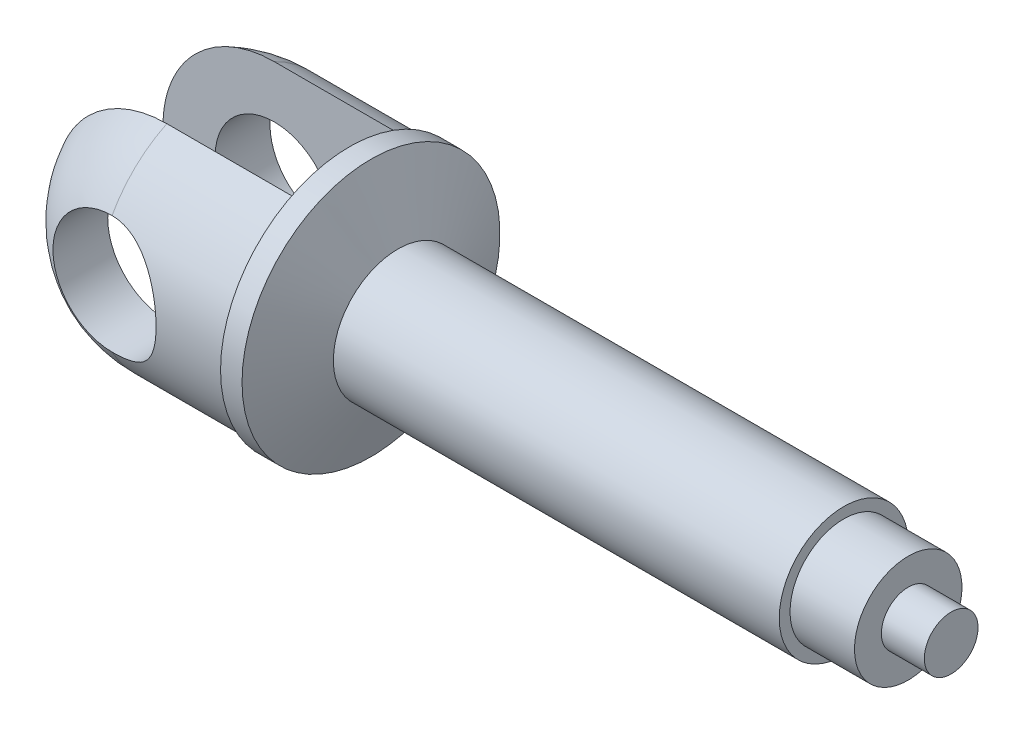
ISO-10303-21;
HEADER;
FILE_DESCRIPTION(('STEP AP214'),'2;1');
FILE_NAME('part.step','',(''),(''),'','','');
FILE_SCHEMA(('AUTOMOTIVE_DESIGN { 1 0 10303 214 1 1 1 1 }'));
ENDSEC;
DATA;
#1=APPLICATION_CONTEXT('core data for automotive mechanical design processes');
#2=APPLICATION_PROTOCOL_DEFINITION('international standard','automotive_design',2000,#1);
#3=PRODUCT_CONTEXT('',#1,'mechanical');
#4=PRODUCT('Part','Part','',(#3));
#5=PRODUCT_RELATED_PRODUCT_CATEGORY('part','',(#4));
#6=PRODUCT_DEFINITION_FORMATION('','',#4);
#7=PRODUCT_DEFINITION_CONTEXT('part definition',#1,'design');
#8=PRODUCT_DEFINITION('design','',#6,#7);
#9=PRODUCT_DEFINITION_SHAPE('','',#8);
#10=(LENGTH_UNIT() NAMED_UNIT(*) SI_UNIT(.MILLI.,.METRE.));
#11=(NAMED_UNIT(*) PLANE_ANGLE_UNIT() SI_UNIT($,.RADIAN.));
#12=(NAMED_UNIT(*) SI_UNIT($,.STERADIAN.) SOLID_ANGLE_UNIT());
#13=UNCERTAINTY_MEASURE_WITH_UNIT(LENGTH_MEASURE(1.E-05),#10,'distance_accuracy_value','');
#14=(GEOMETRIC_REPRESENTATION_CONTEXT(3) GLOBAL_UNCERTAINTY_ASSIGNED_CONTEXT((#13)) GLOBAL_UNIT_ASSIGNED_CONTEXT((#10,
#11,#12)) REPRESENTATION_CONTEXT('',''));
#15=CARTESIAN_POINT('',(0.,0.,0.));
#16=DIRECTION('',(0.,0.,1.));
#17=DIRECTION('',(1.,0.,0.));
#18=AXIS2_PLACEMENT_3D('',#15,#16,#17);
#19=CARTESIAN_POINT('',(-136.,0.,0.));
#20=DIRECTION('',(-1.,0.,0.));
#21=DIRECTION('',(0.,0.,1.));
#22=AXIS2_PLACEMENT_3D('',#19,#20,#21);
#23=CYLINDRICAL_SURFACE('',#22,23.);
#24=CARTESIAN_POINT('',(-136.,0.,0.));
#25=DIRECTION('',(-1.,0.,0.));
#26=DIRECTION('',(0.,0.,1.));
#27=AXIS2_PLACEMENT_3D('',#24,#25,#26);
#28=CIRCLE('',#27,23.);
#29=CARTESIAN_POINT('',(-136.,11.,20.1990098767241));
#30=VERTEX_POINT('',#29);
#31=CARTESIAN_POINT('',(-136.,20.712315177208,10.));
#32=VERTEX_POINT('',#31);
#33=EDGE_CURVE('E109',#30,#32,#28,.T.);
#34=ORIENTED_EDGE('',*,*,#33,.F.);
#35=CARTESIAN_POINT('',(-136.,11.,20.1990098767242));
#36=CARTESIAN_POINT('',(-135.855019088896,11.0000009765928,20.1990068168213));
#37=CARTESIAN_POINT('',(-135.710058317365,10.9971331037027,20.2005714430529));
#38=CARTESIAN_POINT('',(-135.420436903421,10.9856774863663,20.2068045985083));
#39=CARTESIAN_POINT('',(-135.27577624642,10.9770900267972,20.2114729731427));
#40=CARTESIAN_POINT('',(-134.842838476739,10.9427924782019,20.2300770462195));
#41=CARTESIAN_POINT('',(-134.555377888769,10.9085471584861,20.2486117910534));
#42=CARTESIAN_POINT('',(-133.986571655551,10.8179778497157,20.2971415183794));
#43=CARTESIAN_POINT('',(-133.705201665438,10.7617719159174,20.327075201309));
#44=CARTESIAN_POINT('',(-133.148912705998,10.6279419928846,20.3973663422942));
#45=CARTESIAN_POINT('',(-132.87399439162,10.5503158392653,20.4377248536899));
#46=CARTESIAN_POINT('',(-132.332944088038,10.3746528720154,20.5274516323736));
#47=CARTESIAN_POINT('',(-132.066794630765,10.2766598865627,20.576800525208));
#48=CARTESIAN_POINT('',(-131.544081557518,10.061053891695,20.6830758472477));
#49=CARTESIAN_POINT('',(-131.287521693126,9.94343330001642,20.740005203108));
#50=CARTESIAN_POINT('',(-130.533754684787,9.56227778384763,20.9198925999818));
#51=CARTESIAN_POINT('',(-130.05268558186,9.27052305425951,21.0519103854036));
#52=CARTESIAN_POINT('',(-129.108612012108,8.59479159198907,21.3371347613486));
#53=CARTESIAN_POINT('',(-128.649619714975,8.20556564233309,21.4911871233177));
#54=CARTESIAN_POINT('',(-128.013007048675,7.56955566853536,21.7198729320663));
#55=CARTESIAN_POINT('',(-127.809338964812,7.34870448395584,21.795748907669));
#56=CARTESIAN_POINT('',(-127.420379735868,6.89059554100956,21.9448767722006));
#57=CARTESIAN_POINT('',(-127.23508190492,6.65334380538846,22.0181296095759));
#58=CARTESIAN_POINT('',(-126.873321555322,6.1486525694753,22.1645494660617));
#59=CARTESIAN_POINT('',(-126.698082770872,5.88025462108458,22.237440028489));
#60=CARTESIAN_POINT('',(-126.371003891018,5.32780141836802,22.3762291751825));
#61=CARTESIAN_POINT('',(-126.219165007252,5.04374535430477,22.4421273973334));
#62=CARTESIAN_POINT('',(-125.940423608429,4.46194116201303,22.5650045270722));
#63=CARTESIAN_POINT('',(-125.813510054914,4.16419916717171,22.6219873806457));
#64=CARTESIAN_POINT('',(-125.585953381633,3.55706324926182,22.7253621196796));
#65=CARTESIAN_POINT('',(-125.48530774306,3.2476704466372,22.7717550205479));
#66=CARTESIAN_POINT('',(-125.317277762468,2.64045999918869,22.8498446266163));
#67=CARTESIAN_POINT('',(-125.248135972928,2.34322700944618,22.8823094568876));
#68=CARTESIAN_POINT('',(-125.134685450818,1.7430415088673,22.9358355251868));
#69=CARTESIAN_POINT('',(-125.090375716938,1.44008922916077,22.9568972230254));
#70=CARTESIAN_POINT('',(-125.027170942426,0.831085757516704,22.987000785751));
#71=CARTESIAN_POINT('',(-125.00826459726,0.525036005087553,22.9960479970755));
#72=CARTESIAN_POINT('',(-124.996083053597,-0.0876829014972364,23.0018728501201));
#73=CARTESIAN_POINT('',(-125.002806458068,-0.394352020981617,22.9986511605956));
#74=CARTESIAN_POINT('',(-125.040228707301,-0.981253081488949,22.9807822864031));
#75=CARTESIAN_POINT('',(-125.068970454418,-1.26164089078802,22.9670678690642));
#76=CARTESIAN_POINT('',(-125.14774712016,-1.81871733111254,22.9296792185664));
#77=CARTESIAN_POINT('',(-125.197780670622,-2.09540619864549,22.9060056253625));
#78=CARTESIAN_POINT('',(-125.318611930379,-2.64322368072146,22.8492715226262));
#79=CARTESIAN_POINT('',(-125.389409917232,-2.91435222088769,22.8162108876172));
#80=CARTESIAN_POINT('',(-125.551068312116,-3.44933718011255,22.7414828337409));
#81=CARTESIAN_POINT('',(-125.64192940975,-3.71319334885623,22.6998151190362));
#82=CARTESIAN_POINT('',(-125.844345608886,-4.23583822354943,22.6081633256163));
#83=CARTESIAN_POINT('',(-125.956179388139,-4.49449957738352,22.5580683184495));
#84=CARTESIAN_POINT('',(-126.198726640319,-5.00140718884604,22.4511280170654));
#85=CARTESIAN_POINT('',(-126.329446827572,-5.24964970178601,22.3942803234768));
#86=CARTESIAN_POINT('',(-126.748468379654,-5.9767758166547,22.2154612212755));
#87=CARTESIAN_POINT('',(-127.06375037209,-6.43836433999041,22.0851578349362));
#88=CARTESIAN_POINT('',(-127.789221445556,-7.34502606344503,21.8012843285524));
#89=CARTESIAN_POINT('',(-128.20533293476,-7.78504117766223,21.6466757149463));
#90=CARTESIAN_POINT('',(-128.879247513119,-8.38965271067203,21.4163615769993));
#91=CARTESIAN_POINT('',(-129.112371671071,-8.58207893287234,21.3397994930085));
#92=CARTESIAN_POINT('',(-129.594278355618,-8.94752022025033,21.1891689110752));
#93=CARTESIAN_POINT('',(-129.843063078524,-9.12053255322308,21.11510076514));
#94=CARTESIAN_POINT('',(-130.369160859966,-9.45495177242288,20.9675736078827));
#95=CARTESIAN_POINT('',(-130.647290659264,-9.61518988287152,20.8943741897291));
#96=CARTESIAN_POINT('',(-131.21787942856,-9.91133624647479,20.7555331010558));
#97=CARTESIAN_POINT('',(-131.510332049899,-10.0472551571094,20.6898881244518));
#98=CARTESIAN_POINT('',(-132.107361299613,-10.2932693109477,20.5686026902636));
#99=CARTESIAN_POINT('',(-132.411917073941,-10.4034068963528,20.5129458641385));
#100=CARTESIAN_POINT('',(-133.031204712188,-10.5967680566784,20.4137282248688));
#101=CARTESIAN_POINT('',(-133.345932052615,-10.6800034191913,20.3701621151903));
#102=CARTESIAN_POINT('',(-134.046100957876,-10.8321022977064,20.2897641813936));
#103=CARTESIAN_POINT('',(-134.433253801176,-10.8948997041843,20.2559520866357));
#104=CARTESIAN_POINT('',(-135.01827359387,-10.957867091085,20.2219098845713));
#105=CARTESIAN_POINT('',(-135.214126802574,-10.9736515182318,20.2133416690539));
#106=CARTESIAN_POINT('',(-135.606634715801,-10.9947211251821,20.2018857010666));
#107=CARTESIAN_POINT('',(-135.803289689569,-11.0000024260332,20.1990000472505));
#108=CARTESIAN_POINT('',(-136.,-11.,20.1990098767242));
#109=B_SPLINE_CURVE_WITH_KNOTS('',3,(#35,#36,#37,#38,#39,#40,#41,#42,#43,#44,#45,#46,#47,#48,
#49,#50,#51,#52,#53,#54,#55,#56,#57,#58,#59,#60,#61,#62,#63,#64,#65,#66,#67,#68,#69,#70,#71,#72,
#73,#74,#75,#76,#77,#78,#79,#80,#81,#82,#83,#84,#85,#86,#87,#88,#89,#90,#91,#92,#93,#94,#95,#96,
#97,#98,#99,#100,#101,#102,#103,#104,#105,#106,#107,#108),.UNSPECIFIED.,.F.,.F.,(4,2,2,2,2,2,2,
2,2,2,2,2,2,2,2,2,2,2,2,2,2,2,2,2,2,2,2,2,2,2,2,2,2,2,2,2,4),(0.,0.434866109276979,
0.869710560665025,1.73871892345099,2.60311858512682,3.46760562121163,4.33025124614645,
5.19323089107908,6.91990369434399,8.77514242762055,9.70391075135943,10.6323397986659,
11.6172637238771,12.6022386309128,13.5867763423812,14.5712196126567,15.4906593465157,
16.4100620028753,17.3290553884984,18.247998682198,19.0935720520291,19.9390910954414,
20.7846214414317,21.6301808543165,22.4878941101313,23.3459130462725,25.0609611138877,
26.9274624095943,27.8621247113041,28.7969183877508,29.7833424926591,30.7693332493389,
31.7536931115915,32.7376210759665,33.9154782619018,34.5051908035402,35.0951210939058),.UNSPECIFIED.);
#110=CARTESIAN_POINT('',(-136.,-11.,20.1990098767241));
#111=VERTEX_POINT('',#110);
#112=EDGE_CURVE('E48',#30,#111,#109,.T.);
#113=ORIENTED_EDGE('',*,*,#112,.T.);
#114=CARTESIAN_POINT('',(-136.,-20.712315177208,10.));
#115=VERTEX_POINT('',#114);
#116=EDGE_CURVE('E105',#115,#111,#28,.T.);
#117=ORIENTED_EDGE('',*,*,#116,.F.);
#118=DIRECTION('',(-1.,0.,0.));
#119=VECTOR('',#118,1.);
#120=CARTESIAN_POINT('',(-136.,-20.712315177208,10.));
#121=LINE('',#120,#119);
#122=CARTESIAN_POINT('',(-112.,-20.712315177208,10.));
#123=VERTEX_POINT('',#122);
#124=EDGE_CURVE('E115',#123,#115,#121,.T.);
#125=ORIENTED_EDGE('',*,*,#124,.F.);
#126=CARTESIAN_POINT('',(-112.,0.,0.));
#127=DIRECTION('',(-1.,0.,0.));
#128=DIRECTION('',(0.,0.,1.));
#129=AXIS2_PLACEMENT_3D('',#126,#127,#128);
#130=CIRCLE('',#129,23.);
#131=CARTESIAN_POINT('',(-112.,20.712315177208,10.));
#132=VERTEX_POINT('',#131);
#133=EDGE_CURVE('E103',#123,#132,#130,.T.);
#134=ORIENTED_EDGE('',*,*,#133,.T.);
#135=DIRECTION('',(-1.,0.,0.));
#136=VECTOR('',#135,1.);
#137=CARTESIAN_POINT('',(-136.,20.712315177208,10.));
#138=LINE('',#137,#136);
#139=EDGE_CURVE('E117',#32,#132,#138,.F.);
#140=ORIENTED_EDGE('',*,*,#139,.F.);
#141=EDGE_LOOP('',(#34,#113,#117,#125,#134,#140));
#142=FACE_BOUND('',#141,.T.);
#143=ADVANCED_FACE('F33',(#142),#23,.T.);
#144=CARTESIAN_POINT('',(-136.,0.,0.));
#145=DIRECTION('',(-1.,0.,0.));
#146=DIRECTION('',(0.,1.,0.));
#147=AXIS2_PLACEMENT_3D('',#144,#145,#146);
#148=SPHERICAL_SURFACE('',#147,23.);
#149=ORIENTED_EDGE('',*,*,#116,.T.);
#150=CARTESIAN_POINT('',(-136.,0.,20.1990098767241));
#151=DIRECTION('',(0.,0.,-1.));
#152=DIRECTION('',(-1.,0.,0.));
#153=AXIS2_PLACEMENT_3D('',#150,#151,#152);
#154=CIRCLE('',#153,11.);
#155=EDGE_CURVE('E98',#111,#30,#154,.T.);
#156=ORIENTED_EDGE('',*,*,#155,.T.);
#157=ORIENTED_EDGE('',*,*,#33,.T.);
#158=CARTESIAN_POINT('',(-136.,0.,10.));
#159=DIRECTION('',(0.,0.,-1.));
#160=DIRECTION('',(-1.,0.,0.));
#161=AXIS2_PLACEMENT_3D('',#158,#159,#160);
#162=CIRCLE('',#161,20.712315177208);
#163=EDGE_CURVE('E11',#115,#32,#162,.T.);
#164=ORIENTED_EDGE('',*,*,#163,.F.);
#165=EDGE_LOOP('',(#149,#156,#157,#164));
#166=FACE_BOUND('',#165,.T.);
#167=ADVANCED_FACE('F165',(#166),#148,.T.);
#168=CARTESIAN_POINT('',(0.,0.,0.));
#169=DIRECTION('',(-1.,0.,0.));
#170=DIRECTION('',(0.,0.,1.));
#171=AXIS2_PLACEMENT_3D('',#168,#169,#170);
#172=PLANE('',#171);
#173=CARTESIAN_POINT('',(0.,0.,0.));
#174=DIRECTION('',(-1.,0.,0.));
#175=DIRECTION('',(0.,0.,1.));
#176=AXIS2_PLACEMENT_3D('',#173,#174,#175);
#177=CIRCLE('',#176,5.);
#178=CARTESIAN_POINT('',(0.,0.,5.));
#179=VERTEX_POINT('',#178);
#180=EDGE_CURVE('E218',#179,#179,#177,.T.);
#181=ORIENTED_EDGE('',*,*,#180,.F.);
#182=EDGE_LOOP('',(#181));
#183=FACE_BOUND('',#182,.T.);
#184=ADVANCED_FACE('F35',(#183),#172,.F.);
#185=CARTESIAN_POINT('',(-136.,0.,0.));
#186=DIRECTION('',(-1.,0.,0.));
#187=DIRECTION('',(0.,0.,1.));
#188=AXIS2_PLACEMENT_3D('',#185,#186,#187);
#189=CYLINDRICAL_SURFACE('',#188,5.);
#190=CARTESIAN_POINT('',(-8.00000000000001,0.,0.));
#191=DIRECTION('',(-1.,0.,0.));
#192=DIRECTION('',(0.,0.,1.));
#193=AXIS2_PLACEMENT_3D('',#190,#191,#192);
#194=CIRCLE('',#193,5.);
#195=CARTESIAN_POINT('',(-8.00000000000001,0.,5.));
#196=VERTEX_POINT('',#195);
#197=EDGE_CURVE('E215',#196,#196,#194,.T.);
#198=ORIENTED_EDGE('',*,*,#197,.F.);
#199=EDGE_LOOP('',(#198));
#200=FACE_BOUND('',#199,.T.);
#201=ORIENTED_EDGE('',*,*,#180,.T.);
#202=EDGE_LOOP('',(#201));
#203=FACE_BOUND('',#202,.T.);
#204=ADVANCED_FACE('F204',(#200,#203),#189,.T.);
#205=CARTESIAN_POINT('',(-8.,5.,0.));
#206=DIRECTION('',(-1.,0.,0.));
#207=DIRECTION('',(0.,0.,1.));
#208=AXIS2_PLACEMENT_3D('',#205,#206,#207);
#209=PLANE('',#208);
#210=CARTESIAN_POINT('',(-8.00000000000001,0.,0.));
#211=DIRECTION('',(-1.,0.,0.));
#212=DIRECTION('',(0.,0.,1.));
#213=AXIS2_PLACEMENT_3D('',#210,#211,#212);
#214=CIRCLE('',#213,10.);
#215=CARTESIAN_POINT('',(-8.00000000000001,0.,10.));
#216=VERTEX_POINT('',#215);
#217=EDGE_CURVE('E221',#216,#216,#214,.T.);
#218=ORIENTED_EDGE('',*,*,#217,.F.);
#219=EDGE_LOOP('',(#218));
#220=FACE_BOUND('',#219,.T.);
#221=ORIENTED_EDGE('',*,*,#197,.T.);
#222=EDGE_LOOP('',(#221));
#223=FACE_BOUND('',#222,.T.);
#224=ADVANCED_FACE('F201',(#220,#223),#209,.F.);
#225=CARTESIAN_POINT('',(-136.,0.,0.));
#226=DIRECTION('',(-1.,0.,0.));
#227=DIRECTION('',(0.,0.,1.));
#228=AXIS2_PLACEMENT_3D('',#225,#226,#227);
#229=CYLINDRICAL_SURFACE('',#228,10.);
#230=CARTESIAN_POINT('',(-20.,0.,0.));
#231=DIRECTION('',(-1.,0.,0.));
#232=DIRECTION('',(0.,0.,1.));
#233=AXIS2_PLACEMENT_3D('',#230,#231,#232);
#234=CIRCLE('',#233,10.);
#235=CARTESIAN_POINT('',(-20.,0.,10.));
#236=VERTEX_POINT('',#235);
#237=EDGE_CURVE('E226',#236,#236,#234,.T.);
#238=ORIENTED_EDGE('',*,*,#237,.F.);
#239=EDGE_LOOP('',(#238));
#240=FACE_BOUND('',#239,.T.);
#241=ORIENTED_EDGE('',*,*,#217,.T.);
#242=EDGE_LOOP('',(#241));
#243=FACE_BOUND('',#242,.T.);
#244=ADVANCED_FACE('F197',(#240,#243),#229,.T.);
#245=CARTESIAN_POINT('',(-20.,10.,0.));
#246=DIRECTION('',(-1.,0.,0.));
#247=DIRECTION('',(0.,0.,1.));
#248=AXIS2_PLACEMENT_3D('',#245,#246,#247);
#249=PLANE('',#248);
#250=CARTESIAN_POINT('',(-20.,0.,0.));
#251=DIRECTION('',(-1.,0.,0.));
#252=DIRECTION('',(0.,0.,1.));
#253=AXIS2_PLACEMENT_3D('',#250,#251,#252);
#254=CIRCLE('',#253,12.);
#255=CARTESIAN_POINT('',(-20.,0.,12.));
#256=VERTEX_POINT('',#255);
#257=EDGE_CURVE('E229',#256,#256,#254,.T.);
#258=ORIENTED_EDGE('',*,*,#257,.F.);
#259=EDGE_LOOP('',(#258));
#260=FACE_BOUND('',#259,.T.);
#261=ORIENTED_EDGE('',*,*,#237,.T.);
#262=EDGE_LOOP('',(#261));
#263=FACE_BOUND('',#262,.T.);
#264=ADVANCED_FACE('F193',(#260,#263),#249,.F.);
#265=CARTESIAN_POINT('',(-136.,0.,0.));
#266=DIRECTION('',(-1.,0.,0.));
#267=DIRECTION('',(0.,0.,1.));
#268=AXIS2_PLACEMENT_3D('',#265,#266,#267);
#269=CYLINDRICAL_SURFACE('',#268,12.);
#270=CARTESIAN_POINT('',(-103.,0.,0.));
#271=DIRECTION('',(-1.,0.,0.));
#272=DIRECTION('',(0.,0.,1.));
#273=AXIS2_PLACEMENT_3D('',#270,#271,#272);
#274=CIRCLE('',#273,12.);
#275=CARTESIAN_POINT('',(-103.,0.,12.));
#276=VERTEX_POINT('',#275);
#277=EDGE_CURVE('E232',#276,#276,#274,.T.);
#278=ORIENTED_EDGE('',*,*,#277,.F.);
#279=EDGE_LOOP('',(#278));
#280=FACE_BOUND('',#279,.T.);
#281=ORIENTED_EDGE('',*,*,#257,.T.);
#282=EDGE_LOOP('',(#281));
#283=FACE_BOUND('',#282,.T.);
#284=ADVANCED_FACE('F189',(#280,#283),#269,.T.);
#285=CARTESIAN_POINT('',(-103.,0.,0.));
#286=DIRECTION('',(-1.,0.,0.));
#287=DIRECTION('',(0.,0.,1.));
#288=AXIS2_PLACEMENT_3D('',#285,#286,#287);
#289=CONICAL_SURFACE('',#288,12.,1.17600520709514);
#290=CARTESIAN_POINT('',(-108.,0.,0.));
#291=DIRECTION('',(-1.,0.,0.));
#292=DIRECTION('',(0.,0.,1.));
#293=AXIS2_PLACEMENT_3D('',#290,#291,#292);
#294=CIRCLE('',#293,24.);
#295=CARTESIAN_POINT('',(-108.,0.,24.));
#296=VERTEX_POINT('',#295);
#297=EDGE_CURVE('E235',#296,#296,#294,.T.);
#298=ORIENTED_EDGE('',*,*,#297,.F.);
#299=EDGE_LOOP('',(#298));
#300=FACE_BOUND('',#299,.T.);
#301=ORIENTED_EDGE('',*,*,#277,.T.);
#302=EDGE_LOOP('',(#301));
#303=FACE_BOUND('',#302,.T.);
#304=ADVANCED_FACE('F181',(#300,#303),#289,.T.);
#305=CARTESIAN_POINT('',(-136.,0.,0.));
#306=DIRECTION('',(-1.,0.,0.));
#307=DIRECTION('',(0.,0.,1.));
#308=AXIS2_PLACEMENT_3D('',#305,#306,#307);
#309=CYLINDRICAL_SURFACE('',#308,24.);
#310=CARTESIAN_POINT('',(-112.,0.,0.));
#311=DIRECTION('',(-1.,0.,0.));
#312=DIRECTION('',(0.,0.,1.));
#313=AXIS2_PLACEMENT_3D('',#310,#311,#312);
#314=CIRCLE('',#313,24.);
#315=CARTESIAN_POINT('',(-112.,0.,24.));
#316=VERTEX_POINT('',#315);
#317=EDGE_CURVE('E238',#316,#316,#314,.T.);
#318=ORIENTED_EDGE('',*,*,#317,.F.);
#319=EDGE_LOOP('',(#318));
#320=FACE_BOUND('',#319,.T.);
#321=ORIENTED_EDGE('',*,*,#297,.T.);
#322=EDGE_LOOP('',(#321));
#323=FACE_BOUND('',#322,.T.);
#324=ADVANCED_FACE('F176',(#320,#323),#309,.T.);
#325=CARTESIAN_POINT('',(-112.,23.,0.));
#326=DIRECTION('',(1.,0.,0.));
#327=DIRECTION('',(0.,0.,-1.));
#328=AXIS2_PLACEMENT_3D('',#325,#326,#327);
#329=PLANE('',#328);
#330=ORIENTED_EDGE('',*,*,#133,.F.);
#331=DIRECTION('',(0.,1.,0.));
#332=VECTOR('',#331,1.);
#333=CARTESIAN_POINT('',(-112.,29.3547706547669,10.));
#334=LINE('',#333,#332);
#335=EDGE_CURVE('E126',#123,#132,#334,.T.);
#336=ORIENTED_EDGE('',*,*,#335,.T.);
#337=EDGE_LOOP('',(#330,#336));
#338=FACE_BOUND('',#337,.T.);
#339=DIRECTION('',(0.,1.,0.));
#340=VECTOR('',#339,1.);
#341=CARTESIAN_POINT('',(-112.,29.3547706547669,-10.));
#342=LINE('',#341,#340);
#343=CARTESIAN_POINT('',(-112.,-20.712315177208,-10.));
#344=VERTEX_POINT('',#343);
#345=CARTESIAN_POINT('',(-112.,20.712315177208,-10.));
#346=VERTEX_POINT('',#345);
#347=EDGE_CURVE('E129',#344,#346,#342,.T.);
#348=ORIENTED_EDGE('',*,*,#347,.F.);
#349=EDGE_CURVE('E107',#346,#344,#130,.T.);
#350=ORIENTED_EDGE('',*,*,#349,.F.);
#351=EDGE_LOOP('',(#348,#350));
#352=FACE_BOUND('',#351,.T.);
#353=ORIENTED_EDGE('',*,*,#317,.T.);
#354=EDGE_LOOP('',(#353));
#355=FACE_BOUND('',#354,.T.);
#356=ADVANCED_FACE('F171',(#338,#352,#355),#329,.F.);
#357=CARTESIAN_POINT('',(-136.,-11.,-20.1990098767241));
#358=VERTEX_POINT('',#357);
#359=CARTESIAN_POINT('',(-136.,-20.712315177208,-10.));
#360=VERTEX_POINT('',#359);
#361=EDGE_CURVE('E97',#358,#360,#28,.T.);
#362=ORIENTED_EDGE('',*,*,#361,.F.);
#363=CARTESIAN_POINT('',(-136.,-11.,-20.1990098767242));
#364=CARTESIAN_POINT('',(-135.855019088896,-11.0000009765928,-20.1990068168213));
#365=CARTESIAN_POINT('',(-135.710058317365,-10.9971331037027,-20.2005714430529));
#366=CARTESIAN_POINT('',(-135.420436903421,-10.9856774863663,-20.2068045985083));
#367=CARTESIAN_POINT('',(-135.27577624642,-10.9770900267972,-20.2114729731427));
#368=CARTESIAN_POINT('',(-134.842838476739,-10.9427924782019,-20.2300770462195));
#369=CARTESIAN_POINT('',(-134.555377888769,-10.9085471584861,-20.2486117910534));
#370=CARTESIAN_POINT('',(-133.986571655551,-10.8179778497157,-20.2971415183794));
#371=CARTESIAN_POINT('',(-133.705201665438,-10.7617719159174,-20.327075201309));
#372=CARTESIAN_POINT('',(-133.148912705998,-10.6279419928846,-20.3973663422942));
#373=CARTESIAN_POINT('',(-132.87399439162,-10.5503158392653,-20.4377248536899));
#374=CARTESIAN_POINT('',(-132.332944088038,-10.3746528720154,-20.5274516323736));
#375=CARTESIAN_POINT('',(-132.066794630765,-10.2766598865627,-20.576800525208));
#376=CARTESIAN_POINT('',(-131.544081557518,-10.061053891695,-20.6830758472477));
#377=CARTESIAN_POINT('',(-131.287521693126,-9.94343330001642,-20.740005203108));
#378=CARTESIAN_POINT('',(-130.533754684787,-9.56227778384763,-20.9198925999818));
#379=CARTESIAN_POINT('',(-130.05268558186,-9.27052305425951,-21.0519103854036));
#380=CARTESIAN_POINT('',(-129.108612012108,-8.59479159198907,-21.3371347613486));
#381=CARTESIAN_POINT('',(-128.649619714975,-8.20556564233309,-21.4911871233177));
#382=CARTESIAN_POINT('',(-128.013007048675,-7.56955566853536,-21.7198729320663));
#383=CARTESIAN_POINT('',(-127.809338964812,-7.34870448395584,-21.795748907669));
#384=CARTESIAN_POINT('',(-127.420379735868,-6.89059554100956,-21.9448767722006));
#385=CARTESIAN_POINT('',(-127.23508190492,-6.65334380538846,-22.0181296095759));
#386=CARTESIAN_POINT('',(-126.873321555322,-6.1486525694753,-22.1645494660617));
#387=CARTESIAN_POINT('',(-126.698082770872,-5.88025462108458,-22.237440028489));
#388=CARTESIAN_POINT('',(-126.371003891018,-5.32780141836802,-22.3762291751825));
#389=CARTESIAN_POINT('',(-126.219165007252,-5.04374535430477,-22.4421273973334));
#390=CARTESIAN_POINT('',(-125.940423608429,-4.46194116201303,-22.5650045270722));
#391=CARTESIAN_POINT('',(-125.813510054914,-4.16419916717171,-22.6219873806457));
#392=CARTESIAN_POINT('',(-125.585953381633,-3.55706324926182,-22.7253621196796));
#393=CARTESIAN_POINT('',(-125.48530774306,-3.2476704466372,-22.7717550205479));
#394=CARTESIAN_POINT('',(-125.317277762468,-2.64045999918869,-22.8498446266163));
#395=CARTESIAN_POINT('',(-125.248135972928,-2.34322700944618,-22.8823094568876));
#396=CARTESIAN_POINT('',(-125.134685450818,-1.7430415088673,-22.9358355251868));
#397=CARTESIAN_POINT('',(-125.090375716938,-1.44008922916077,-22.9568972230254));
#398=CARTESIAN_POINT('',(-125.027170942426,-0.831085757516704,-22.987000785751));
#399=CARTESIAN_POINT('',(-125.00826459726,-0.525036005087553,-22.9960479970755));
#400=CARTESIAN_POINT('',(-124.996083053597,0.0876829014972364,-23.0018728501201));
#401=CARTESIAN_POINT('',(-125.002806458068,0.394352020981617,-22.9986511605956));
#402=CARTESIAN_POINT('',(-125.040228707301,0.981253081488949,-22.9807822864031));
#403=CARTESIAN_POINT('',(-125.068970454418,1.26164089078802,-22.9670678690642));
#404=CARTESIAN_POINT('',(-125.14774712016,1.81871733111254,-22.9296792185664));
#405=CARTESIAN_POINT('',(-125.197780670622,2.09540619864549,-22.9060056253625));
#406=CARTESIAN_POINT('',(-125.318611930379,2.64322368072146,-22.8492715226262));
#407=CARTESIAN_POINT('',(-125.389409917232,2.91435222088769,-22.8162108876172));
#408=CARTESIAN_POINT('',(-125.551068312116,3.44933718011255,-22.7414828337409));
#409=CARTESIAN_POINT('',(-125.64192940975,3.71319334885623,-22.6998151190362));
#410=CARTESIAN_POINT('',(-125.844345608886,4.23583822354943,-22.6081633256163));
#411=CARTESIAN_POINT('',(-125.956179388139,4.49449957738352,-22.5580683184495));
#412=CARTESIAN_POINT('',(-126.198726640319,5.00140718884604,-22.4511280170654));
#413=CARTESIAN_POINT('',(-126.329446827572,5.24964970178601,-22.3942803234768));
#414=CARTESIAN_POINT('',(-126.748468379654,5.9767758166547,-22.2154612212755));
#415=CARTESIAN_POINT('',(-127.06375037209,6.43836433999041,-22.0851578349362));
#416=CARTESIAN_POINT('',(-127.789221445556,7.34502606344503,-21.8012843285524));
#417=CARTESIAN_POINT('',(-128.20533293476,7.78504117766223,-21.6466757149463));
#418=CARTESIAN_POINT('',(-128.879247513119,8.38965271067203,-21.4163615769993));
#419=CARTESIAN_POINT('',(-129.112371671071,8.58207893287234,-21.3397994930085));
#420=CARTESIAN_POINT('',(-129.594278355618,8.94752022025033,-21.1891689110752));
#421=CARTESIAN_POINT('',(-129.843063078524,9.12053255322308,-21.11510076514));
#422=CARTESIAN_POINT('',(-130.369160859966,9.45495177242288,-20.9675736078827));
#423=CARTESIAN_POINT('',(-130.647290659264,9.61518988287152,-20.8943741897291));
#424=CARTESIAN_POINT('',(-131.21787942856,9.91133624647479,-20.7555331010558));
#425=CARTESIAN_POINT('',(-131.510332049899,10.0472551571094,-20.6898881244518));
#426=CARTESIAN_POINT('',(-132.107361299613,10.2932693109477,-20.5686026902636));
#427=CARTESIAN_POINT('',(-132.411917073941,10.4034068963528,-20.5129458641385));
#428=CARTESIAN_POINT('',(-133.031204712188,10.5967680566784,-20.4137282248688));
#429=CARTESIAN_POINT('',(-133.345932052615,10.6800034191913,-20.3701621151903));
#430=CARTESIAN_POINT('',(-134.046100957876,10.8321022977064,-20.2897641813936));
#431=CARTESIAN_POINT('',(-134.433253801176,10.8948997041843,-20.2559520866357));
#432=CARTESIAN_POINT('',(-135.01827359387,10.957867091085,-20.2219098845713));
#433=CARTESIAN_POINT('',(-135.214126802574,10.9736515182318,-20.2133416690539));
#434=CARTESIAN_POINT('',(-135.606634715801,10.9947211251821,-20.2018857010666));
#435=CARTESIAN_POINT('',(-135.803289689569,11.0000024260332,-20.1990000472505));
#436=CARTESIAN_POINT('',(-136.,11.,-20.1990098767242));
#437=B_SPLINE_CURVE_WITH_KNOTS('',3,(#363,#364,#365,#366,#367,#368,#369,#370,#371,#372,#373,
#374,#375,#376,#377,#378,#379,#380,#381,#382,#383,#384,#385,#386,#387,#388,#389,#390,#391,#392,
#393,#394,#395,#396,#397,#398,#399,#400,#401,#402,#403,#404,#405,#406,#407,#408,#409,#410,#411,
#412,#413,#414,#415,#416,#417,#418,#419,#420,#421,#422,#423,#424,#425,#426,#427,#428,#429,#430,
#431,#432,#433,#434,#435,#436),.UNSPECIFIED.,.F.,.F.,(4,2,2,2,2,2,2,2,2,2,2,2,2,2,2,2,2,2,2,2,2,
2,2,2,2,2,2,2,2,2,2,2,2,2,2,2,4),(0.,0.434866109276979,0.869710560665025,1.73871892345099,
2.60311858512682,3.46760562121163,4.33025124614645,5.19323089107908,6.91990369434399,
8.77514242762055,9.70391075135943,10.6323397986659,11.6172637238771,12.6022386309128,
13.5867763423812,14.5712196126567,15.4906593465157,16.4100620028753,17.3290553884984,
18.247998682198,19.0935720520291,19.9390910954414,20.7846214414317,21.6301808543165,
22.4878941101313,23.3459130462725,25.0609611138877,26.9274624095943,27.8621247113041,
28.7969183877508,29.7833424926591,30.7693332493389,31.7536931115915,32.7376210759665,
33.9154782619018,34.5051908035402,35.0951210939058),.UNSPECIFIED.);
#438=CARTESIAN_POINT('',(-136.,11.,-20.1990098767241));
#439=VERTEX_POINT('',#438);
#440=EDGE_CURVE('E55',#358,#439,#437,.T.);
#441=ORIENTED_EDGE('',*,*,#440,.T.);
#442=CARTESIAN_POINT('',(-136.,20.712315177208,-10.));
#443=VERTEX_POINT('',#442);
#444=EDGE_CURVE('E95',#443,#439,#28,.T.);
#445=ORIENTED_EDGE('',*,*,#444,.F.);
#446=DIRECTION('',(-1.,0.,0.));
#447=VECTOR('',#446,1.);
#448=CARTESIAN_POINT('',(-136.,20.712315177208,-10.));
#449=LINE('',#448,#447);
#450=EDGE_CURVE('E124',#443,#346,#449,.F.);
#451=ORIENTED_EDGE('',*,*,#450,.T.);
#452=ORIENTED_EDGE('',*,*,#349,.T.);
#453=DIRECTION('',(-1.,0.,0.));
#454=VECTOR('',#453,1.);
#455=CARTESIAN_POINT('',(-136.,-20.712315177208,-10.));
#456=LINE('',#455,#454);
#457=EDGE_CURVE('E120',#344,#360,#456,.T.);
#458=ORIENTED_EDGE('',*,*,#457,.T.);
#459=EDGE_LOOP('',(#362,#441,#445,#451,#452,#458));
#460=FACE_BOUND('',#459,.T.);
#461=ADVANCED_FACE('F93',(#460),#23,.T.);
#462=ORIENTED_EDGE('',*,*,#444,.T.);
#463=CARTESIAN_POINT('',(-136.,0.,-20.1990098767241));
#464=DIRECTION('',(0.,0.,1.));
#465=DIRECTION('',(1.,0.,0.));
#466=AXIS2_PLACEMENT_3D('',#463,#464,#465);
#467=CIRCLE('',#466,11.);
#468=EDGE_CURVE('E84',#439,#358,#467,.T.);
#469=ORIENTED_EDGE('',*,*,#468,.T.);
#470=ORIENTED_EDGE('',*,*,#361,.T.);
#471=CARTESIAN_POINT('',(-136.,0.,-10.));
#472=DIRECTION('',(0.,0.,-1.));
#473=DIRECTION('',(-1.,0.,0.));
#474=AXIS2_PLACEMENT_3D('',#471,#472,#473);
#475=CIRCLE('',#474,20.712315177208);
#476=EDGE_CURVE('E42',#360,#443,#475,.T.);
#477=ORIENTED_EDGE('',*,*,#476,.T.);
#478=EDGE_LOOP('',(#462,#469,#470,#477));
#479=FACE_BOUND('',#478,.T.);
#480=ADVANCED_FACE('F101',(#479),#148,.T.);
#481=CARTESIAN_POINT('',(-112.,29.3547706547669,10.));
#482=DIRECTION('',(0.,0.,-1.));
#483=DIRECTION('',(-1.,0.,0.));
#484=AXIS2_PLACEMENT_3D('',#481,#482,#483);
#485=PLANE('',#484);
#486=CARTESIAN_POINT('',(-136.,0.,10.));
#487=DIRECTION('',(0.,0.,-1.));
#488=DIRECTION('',(-1.,0.,0.));
#489=AXIS2_PLACEMENT_3D('',#486,#487,#488);
#490=CIRCLE('',#489,11.);
#491=CARTESIAN_POINT('',(-147.,0.,10.));
#492=VERTEX_POINT('',#491);
#493=EDGE_CURVE('E89',#492,#492,#490,.T.);
#494=ORIENTED_EDGE('',*,*,#493,.F.);
#495=EDGE_LOOP('',(#494));
#496=FACE_BOUND('',#495,.T.);
#497=ORIENTED_EDGE('',*,*,#124,.T.);
#498=ORIENTED_EDGE('',*,*,#163,.T.);
#499=ORIENTED_EDGE('',*,*,#139,.T.);
#500=ORIENTED_EDGE('',*,*,#335,.F.);
#501=EDGE_LOOP('',(#497,#498,#499,#500));
#502=FACE_BOUND('',#501,.T.);
#503=ADVANCED_FACE('F163',(#496,#502),#485,.T.);
#504=CARTESIAN_POINT('',(-112.,29.3547706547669,-10.));
#505=DIRECTION('',(0.,0.,-1.));
#506=DIRECTION('',(-1.,0.,0.));
#507=AXIS2_PLACEMENT_3D('',#504,#505,#506);
#508=PLANE('',#507);
#509=CARTESIAN_POINT('',(-136.,0.,-10.));
#510=DIRECTION('',(0.,0.,-1.));
#511=DIRECTION('',(-1.,0.,0.));
#512=AXIS2_PLACEMENT_3D('',#509,#510,#511);
#513=CIRCLE('',#512,11.);
#514=CARTESIAN_POINT('',(-147.,0.,-10.));
#515=VERTEX_POINT('',#514);
#516=EDGE_CURVE('E37',#515,#515,#513,.T.);
#517=ORIENTED_EDGE('',*,*,#516,.T.);
#518=EDGE_LOOP('',(#517));
#519=FACE_BOUND('',#518,.T.);
#520=ORIENTED_EDGE('',*,*,#347,.T.);
#521=ORIENTED_EDGE('',*,*,#450,.F.);
#522=ORIENTED_EDGE('',*,*,#476,.F.);
#523=ORIENTED_EDGE('',*,*,#457,.F.);
#524=EDGE_LOOP('',(#520,#521,#522,#523));
#525=FACE_BOUND('',#524,.T.);
#526=ADVANCED_FACE('F145',(#519,#525),#508,.F.);
#527=CARTESIAN_POINT('',(-136.,0.,-24.));
#528=DIRECTION('',(0.,0.,1.));
#529=DIRECTION('',(1.,0.,0.));
#530=AXIS2_PLACEMENT_3D('',#527,#528,#529);
#531=CYLINDRICAL_SURFACE('',#530,11.);
#532=ORIENTED_EDGE('',*,*,#516,.F.);
#533=EDGE_LOOP('',(#532));
#534=FACE_BOUND('',#533,.T.);
#535=ORIENTED_EDGE('',*,*,#468,.F.);
#536=ORIENTED_EDGE('',*,*,#440,.F.);
#537=EDGE_LOOP('',(#535,#536));
#538=FACE_BOUND('',#537,.T.);
#539=ADVANCED_FACE('F85',(#534,#538),#531,.F.);
#540=ORIENTED_EDGE('',*,*,#493,.T.);
#541=EDGE_LOOP('',(#540));
#542=FACE_BOUND('',#541,.T.);
#543=ORIENTED_EDGE('',*,*,#155,.F.);
#544=ORIENTED_EDGE('',*,*,#112,.F.);
#545=EDGE_LOOP('',(#543,#544));
#546=FACE_BOUND('',#545,.T.);
#547=ADVANCED_FACE('F140',(#542,#546),#531,.F.);
#548=CLOSED_SHELL('',(#143,#167,#184,#204,#224,#244,#264,#284,#304,#324,#356,#461,#480,#503,
#526,#539,#547));
#549=MANIFOLD_SOLID_BREP('B2',#548);
#550=ADVANCED_BREP_SHAPE_REPRESENTATION('',(#18,#549),#14);
#551=SHAPE_DEFINITION_REPRESENTATION(#9,#550);
ENDSEC;
END-ISO-10303-21;
